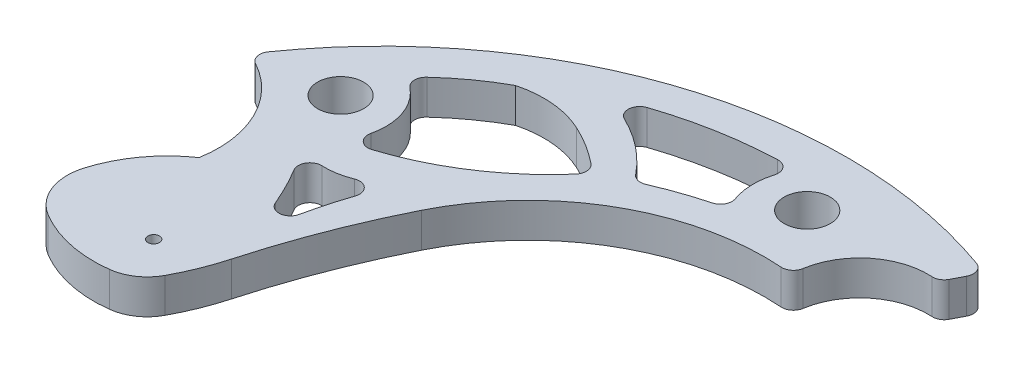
from build123d import *

# Parameters (mm, degrees)
ESQUISSE1_R        = 0.5
ESQUISSE1_R_2      = 2
BOSS_EXTRU_1_DEPTH = 3
CONG_1_R           = 1
CONG_2_R           = 1
CONG_3_R           = 1
CONG_4_R           = 1


with BuildPart() as part:
    # Esquisse1 → Boss.-Extru.1 (new body)
    with BuildSketch(Plane(origin=(0, 0, 0), x_dir=(1, 0, 0), z_dir=(0, 1, 0))):
        with BuildLine():
            Line((37.172374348, 30.855607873), (38.520927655, 33.467056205))
            ThreePointArc((38.520927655, 33.467056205), (11.655549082, 34.291726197), (-9.768012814, 18.060286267))
            ThreePointArc((-9.768012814, 18.060286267), (-5.188940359, 14.080904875), (-4.163935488, 8.10154489))
            ThreePointArc((-4.163935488, 8.10154489), (-6.760171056, 5.571000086), (-8.367678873, 2.321382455))
            ThreePointArc((-8.367678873, 2.321382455), (-8.252453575, -0.547362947), (-6.402076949, -2.742604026))
            ThreePointArc((-6.402076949, -2.742604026), (-3.138577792, -4.02402154), (0.364418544, -4.170562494))
            ThreePointArc((0.364418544, -4.170562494), (2.018158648, -3.543146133), (3.199900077, -2.227093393))
            ThreePointArc((3.199900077, -2.227093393), (4.142751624, -0.213103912), (4.856364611, 1.893048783))
            ThreePointArc((4.856364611, 1.893048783), (6.857568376, 7.951096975), (9.429659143, 13.789685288))
            ThreePointArc((9.429659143, 13.789685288), (18.067423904, 22.7004201), (30.261069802, 25.008487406))
            ThreePointArc((30.261069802, 25.008487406), (32.36066218, 29.534912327), (37.172374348, 30.855607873))
        make_face()
        with Locations(Location((0, 0, 0), (0, 0, 270))):
            Circle(ESQUISSE1_R, mode=Mode.SUBTRACT)
        with Locations(Location((-2.698262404, 18.900988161, 0), (0, 0, 270))):
            Circle(ESQUISSE1_R_2, mode=Mode.SUBTRACT)
        with Locations(Location((26.152205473, 30.495944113, 0), (0, 0, 270))):
            Circle(ESQUISSE1_R_2, mode=Mode.SUBTRACT)
        with BuildLine():
            ThreePointArc((-1.245290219, 23.105292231), (1.289632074, 25.367424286), (4.134222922, 27.225212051))
            ThreePointArc((4.134222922, 27.225212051), (7.092985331, 27.472873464), (9.959842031, 26.700381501))
            ThreePointArc((9.959842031, 26.700381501), (12.111841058, 25.487520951), (14.053366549, 23.960232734))
            ThreePointArc((14.053366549, 23.960232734), (8.068105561, 18.659191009), (0.670341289, 15.626456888))
            ThreePointArc((0.670341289, 15.626456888), (1.442744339, 19.809053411), (-1.245290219, 23.105292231))
        make_face(mode=Mode.SUBTRACT)
        with BuildLine():
            ThreePointArc((8.945221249, 30.312142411), (13.1761991, 28.386880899), (16.49802353, 25.135221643))
            ThreePointArc((16.49802353, 25.135221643), (19.518857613, 26.343024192), (22.650306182, 27.225212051))
            ThreePointArc((22.650306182, 27.225212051), (21.83932711, 30.131682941), (22.650306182, 33.03815383))
            ThreePointArc((22.650306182, 33.03815383), (15.657146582, 32.382103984), (8.945221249, 30.312142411))
        make_face(mode=Mode.SUBTRACT)
        with BuildLine():
            ThreePointArc((-0.524959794, 13.397858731), (3.85567167, 13.110756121), (7.143363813, 16.019955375))
            ThreePointArc((7.143363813, 16.019955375), (4.954139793, 10.240537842), (3.827489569, 4.163941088))
            ThreePointArc((3.827489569, 4.163941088), (2.102079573, 8.993393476), (-0.524959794, 13.397858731))
        make_face(mode=Mode.SUBTRACT)
    extrude(amount=BOSS_EXTRU_1_DEPTH)

    # Cong_1
    cong_1_edges = [part.edges().sort_by_distance(p)[0] for p in [
        (-0.524959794, 1.5, -13.397858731),
        (3.827489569, 1.5, -4.163941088),
        (7.143363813, 1.5, -16.019955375),
    ]]
    fillet(cong_1_edges, radius=CONG_1_R)

    # Cong_2
    cong_2_edges = [part.edges().sort_by_distance(p)[0] for p in [
        (-1.245290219, 1.5, -23.105292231),
        (0.670341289, 1.5, -15.626456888),
        (14.053366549, 1.5, -23.960232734),
    ]]
    fillet(cong_2_edges, radius=CONG_2_R)

    # Cong_3
    cong_3_edges = [part.edges().sort_by_distance(p)[0] for p in [
        (22.650306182, 1.5, -33.03815383),
        (8.945221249, 1.5, -30.312142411),
        (16.49802353, 1.5, -25.135221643),
        (22.650306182, 1.5, -27.225212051),
    ]]
    fillet(cong_3_edges, radius=CONG_3_R)

    # Cong_4
    cong_4_edges = [part.edges().sort_by_distance(p)[0] for p in [
        (30.261069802, 1.5, -25.008487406),
        (-9.768012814, 1.5, -18.060286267),
        (38.520927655, 1.5, -33.467056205),
        (37.172374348, 1.5, -30.855607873),
    ]]
    fillet(cong_4_edges, radius=CONG_4_R)


solid = part.part
